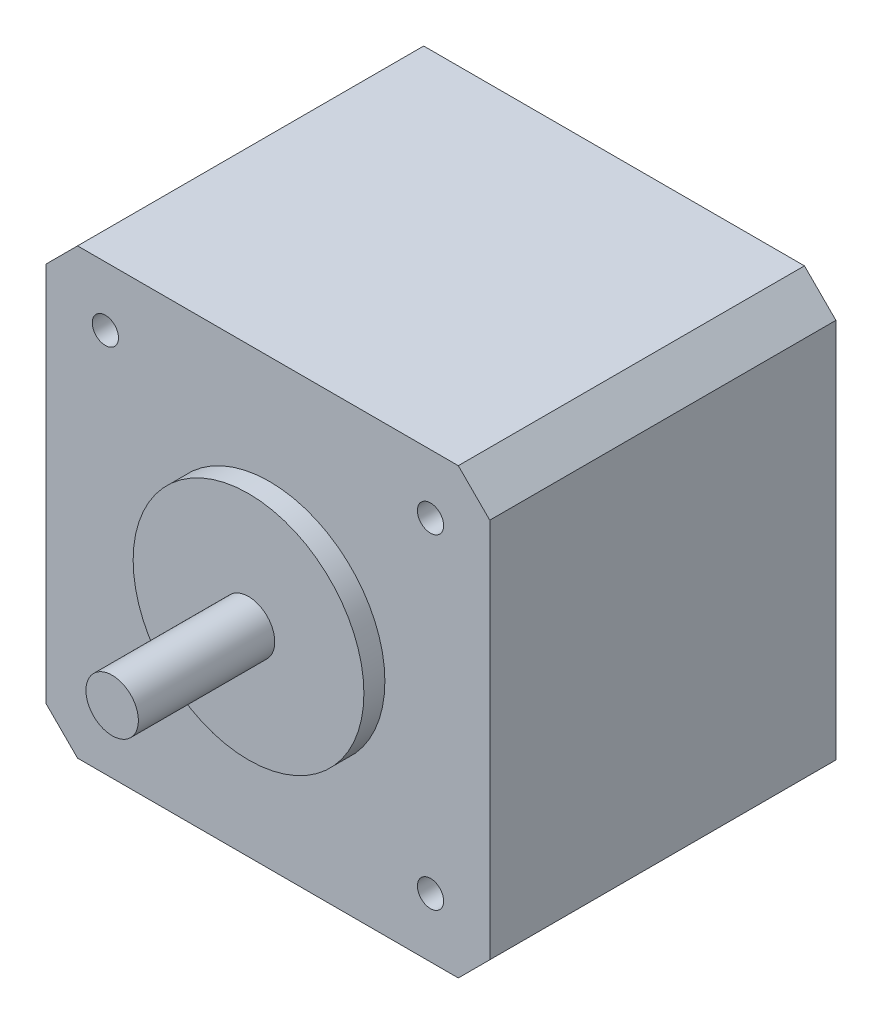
from build123d import *

# Parameters (mm, degrees)
CROQUIS1_W                          = 42.3
CROQUIS1_H                          = 42.3
SALIENTE_EXTRUIR1_DEPTH             = 33
DI_METRO_DE_TALADRO_2_5_2_5_1_D     = 2.5
DI_METRO_DE_TALADRO_2_5_2_5_1_DEPTH = 5
CHAFL_N1_SIZE                       = 3


with BuildPart() as part:
    # Croquis1 → Saliente-Extruir1 (new body)
    with BuildSketch(Plane.XY.offset(33)):
        with Locations((-21.15, 21.15)):
            Rectangle(CROQUIS1_W, CROQUIS1_H)
    extrude(amount=-SALIENTE_EXTRUIR1_DEPTH)

    # Croquis2 → Revoluci_n1 (revolve)
    with BuildSketch(Plane.XZ.offset(-21), mode=Mode.PRIVATE) as revoluci_n1_sk:
        Polygon((-18.5, 48), (-21, 48), (-21, 33), (-10, 33), (-10, 35), (-18.5, 35), align=None)
    revolve(revoluci_n1_sk.sketch.rotate(Axis((-21, 21, 48), (0, 0, -1)), 180), axis=Axis((-21, 21, 48), (0, 0, -1)))

    # Di_metro de taladro _2.5 _2.5_1
    with Locations(Plane.XY.offset(33)):
        with Locations((-36.65, 5.65), (-5.65, 36.65), (-5.65, 5.65), (-36.65, 36.65)):
            Hole(DI_METRO_DE_TALADRO_2_5_2_5_1_D / 2, depth=DI_METRO_DE_TALADRO_2_5_2_5_1_DEPTH)

    # Chafl_n1
    chafl_n1_edges = [part.edges().sort_by_distance(p)[0] for p in [
        (0, 0, 16.5),
        (-42.3, 0, 16.5),
        (-42.3, 42.3, 16.5),
        (0, 42.3, 16.5),
    ]]
    chamfer(chafl_n1_edges, length=CHAFL_N1_SIZE)


solid = part.part
